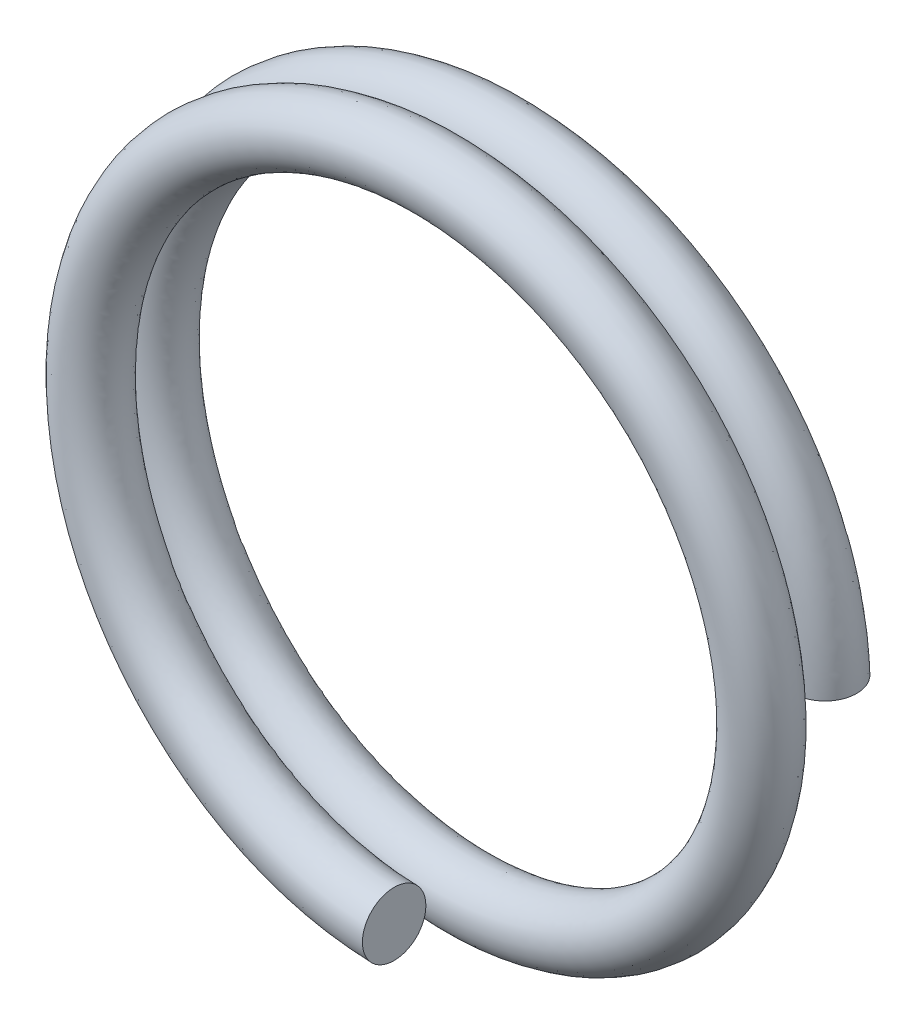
ISO-10303-21;
HEADER;
FILE_DESCRIPTION(('STEP AP214'),'2;1');
FILE_NAME('part.step','',(''),(''),'','','');
FILE_SCHEMA(('AUTOMOTIVE_DESIGN { 1 0 10303 214 1 1 1 1 }'));
ENDSEC;
DATA;
#1=APPLICATION_CONTEXT('core data for automotive mechanical design processes');
#2=APPLICATION_PROTOCOL_DEFINITION('international standard','automotive_design',2000,#1);
#3=PRODUCT_CONTEXT('',#1,'mechanical');
#4=PRODUCT('Part','Part','',(#3));
#5=PRODUCT_RELATED_PRODUCT_CATEGORY('part','',(#4));
#6=PRODUCT_DEFINITION_FORMATION('','',#4);
#7=PRODUCT_DEFINITION_CONTEXT('part definition',#1,'design');
#8=PRODUCT_DEFINITION('design','',#6,#7);
#9=PRODUCT_DEFINITION_SHAPE('','',#8);
#10=(LENGTH_UNIT() NAMED_UNIT(*) SI_UNIT(.MILLI.,.METRE.));
#11=(NAMED_UNIT(*) PLANE_ANGLE_UNIT() SI_UNIT($,.RADIAN.));
#12=(NAMED_UNIT(*) SI_UNIT($,.STERADIAN.) SOLID_ANGLE_UNIT());
#13=UNCERTAINTY_MEASURE_WITH_UNIT(LENGTH_MEASURE(1.E-05),#10,'distance_accuracy_value','');
#14=(GEOMETRIC_REPRESENTATION_CONTEXT(3) GLOBAL_UNCERTAINTY_ASSIGNED_CONTEXT((#13)) GLOBAL_UNIT_ASSIGNED_CONTEXT((#10,
#11,#12)) REPRESENTATION_CONTEXT('',''));
#15=CARTESIAN_POINT('',(0.,0.,0.));
#16=DIRECTION('',(0.,0.,1.));
#17=DIRECTION('',(1.,0.,0.));
#18=AXIS2_PLACEMENT_3D('',#15,#16,#17);
#19=CARTESIAN_POINT('',(0.,-11.1125,0.));
#20=DIRECTION('',(1.,0.,0.));
#21=DIRECTION('',(0.,0.,-1.));
#22=AXIS2_PLACEMENT_3D('',#19,#20,#21);
#23=PLANE('',#22);
#24=CARTESIAN_POINT('',(0.,-11.1125,0.));
#25=DIRECTION('',(1.,0.,0.));
#26=DIRECTION('',(0.,0.,-1.));
#27=AXIS2_PLACEMENT_3D('',#24,#25,#26);
#28=CIRCLE('',#27,1.1049);
#29=CARTESIAN_POINT('',(0.,-11.1125,-1.1049));
#30=VERTEX_POINT('',#29);
#31=EDGE_CURVE('E42',#30,#30,#28,.T.);
#32=ORIENTED_EDGE('',*,*,#31,.T.);
#33=EDGE_LOOP('',(#32));
#34=FACE_BOUND('',#33,.T.);
#35=ADVANCED_FACE('F35',(#34),#23,.T.);
#36=CARTESIAN_POINT('',(11.1125,-2.7159360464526E-13,-3.889375));
#37=DIRECTION('',(0.,1.,0.));
#38=DIRECTION('',(0.,0.,-1.));
#39=AXIS2_PLACEMENT_3D('',#36,#37,#38);
#40=PLANE('',#39);
#41=CARTESIAN_POINT('',(11.1125,-2.7159360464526E-13,-3.889375));
#42=DIRECTION('',(0.,1.,0.));
#43=DIRECTION('',(0.,0.,-1.));
#44=AXIS2_PLACEMENT_3D('',#41,#42,#43);
#45=CIRCLE('',#44,1.1049);
#46=CARTESIAN_POINT('',(11.1125,-2.7159360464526E-13,-4.994275));
#47=VERTEX_POINT('',#46);
#48=EDGE_CURVE('E11',#47,#47,#45,.T.);
#49=ORIENTED_EDGE('',*,*,#48,.F.);
#50=EDGE_LOOP('',(#49));
#51=FACE_BOUND('',#50,.T.);
#52=ADVANCED_FACE('F51',(#51),#40,.F.);
#53=CARTESIAN_POINT('',(0.,-11.1125,-1.1049));
#54=CARTESIAN_POINT('',(-6.41580486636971,-11.1125,-1.29010833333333));
#55=CARTESIAN_POINT('',(-9.62370729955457,-5.55625,-1.47531666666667));
#56=CARTESIAN_POINT('',(-12.8316097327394,0.,-1.660525));
#57=CARTESIAN_POINT('',(-9.62370729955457,5.55625,-1.84573333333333));
#58=CARTESIAN_POINT('',(-6.41580486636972,11.1125,-2.03094166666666));
#59=CARTESIAN_POINT('',(0.,11.1125,-2.21615));
#60=CARTESIAN_POINT('',(6.41580486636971,11.1125,-2.40135833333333));
#61=CARTESIAN_POINT('',(9.62370729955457,5.55625,-2.58656666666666));
#62=CARTESIAN_POINT('',(12.8316097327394,0.,-2.771775));
#63=CARTESIAN_POINT('',(9.62370729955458,-5.55624999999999,-2.95698333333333));
#64=CARTESIAN_POINT('',(6.41580486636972,-11.1125,-3.14219166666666));
#65=CARTESIAN_POINT('',(0.,-11.1125,-3.3274));
#66=CARTESIAN_POINT('',(-6.41580486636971,-11.1125,-3.51260833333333));
#67=CARTESIAN_POINT('',(-9.62370729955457,-5.55625,-3.69781666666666));
#68=CARTESIAN_POINT('',(-12.8316097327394,0.,-3.88302499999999));
#69=CARTESIAN_POINT('',(-9.62370729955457,5.55625,-4.06823333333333));
#70=CARTESIAN_POINT('',(-6.41580486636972,11.1125,-4.25344166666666));
#71=CARTESIAN_POINT('',(0.,11.1125,-4.43864999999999));
#72=CARTESIAN_POINT('',(6.41580486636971,11.1125,-4.62385833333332));
#73=CARTESIAN_POINT('',(9.62370729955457,5.55625,-4.80906666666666));
#74=CARTESIAN_POINT('',(12.8316097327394,0.,-4.99427499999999));
#75=CARTESIAN_POINT('',(9.62370729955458,-5.55624999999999,-5.17948333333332));
#76=CARTESIAN_POINT('',(6.41580486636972,-11.1125,-5.36469166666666));
#77=CARTESIAN_POINT('',(0.,-11.1125,-5.54989999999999));
#78=CARTESIAN_POINT('',(0.,-8.9027,-1.1049));
#79=CARTESIAN_POINT('',(-5.13997624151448,-8.9027,-1.29010833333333));
#80=CARTESIAN_POINT('',(-7.70996436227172,-4.45135,-1.47531666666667));
#81=CARTESIAN_POINT('',(-10.279952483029,0.,-1.660525));
#82=CARTESIAN_POINT('',(-7.70996436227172,4.45135,-1.84573333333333));
#83=CARTESIAN_POINT('',(-5.13997624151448,8.9027,-2.03094166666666));
#84=CARTESIAN_POINT('',(0.,8.9027,-2.21615));
#85=CARTESIAN_POINT('',(5.13997624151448,8.9027,-2.40135833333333));
#86=CARTESIAN_POINT('',(7.70996436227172,4.45135,-2.58656666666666));
#87=CARTESIAN_POINT('',(10.279952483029,0.,-2.771775));
#88=CARTESIAN_POINT('',(7.70996436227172,-4.45134999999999,-2.95698333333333));
#89=CARTESIAN_POINT('',(5.13997624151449,-8.90269999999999,-3.14219166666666));
#90=CARTESIAN_POINT('',(0.,-8.9027,-3.3274));
#91=CARTESIAN_POINT('',(-5.13997624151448,-8.9027,-3.51260833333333));
#92=CARTESIAN_POINT('',(-7.70996436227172,-4.45135,-3.69781666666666));
#93=CARTESIAN_POINT('',(-10.279952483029,0.,-3.88302499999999));
#94=CARTESIAN_POINT('',(-7.70996436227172,4.45135,-4.06823333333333));
#95=CARTESIAN_POINT('',(-5.13997624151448,8.9027,-4.25344166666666));
#96=CARTESIAN_POINT('',(0.,8.9027,-4.43864999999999));
#97=CARTESIAN_POINT('',(5.13997624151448,8.9027,-4.62385833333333));
#98=CARTESIAN_POINT('',(7.70996436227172,4.45135,-4.80906666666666));
#99=CARTESIAN_POINT('',(10.279952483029,0.,-4.99427499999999));
#100=CARTESIAN_POINT('',(7.70996436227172,-4.45134999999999,-5.17948333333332));
#101=CARTESIAN_POINT('',(5.13997624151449,-8.90269999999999,-5.36469166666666));
#102=CARTESIAN_POINT('',(0.,-8.9027,-5.54989999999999));
#103=CARTESIAN_POINT('',(0.,-8.9027,1.1049));
#104=CARTESIAN_POINT('',(-5.13997624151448,-8.9027,0.919691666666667));
#105=CARTESIAN_POINT('',(-7.70996436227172,-4.45135,0.734483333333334));
#106=CARTESIAN_POINT('',(-10.279952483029,0.,0.549275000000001));
#107=CARTESIAN_POINT('',(-7.70996436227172,4.45135,0.364066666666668));
#108=CARTESIAN_POINT('',(-5.13997624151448,8.9027,0.178858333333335));
#109=CARTESIAN_POINT('',(0.,8.9027,-0.00634999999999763));
#110=CARTESIAN_POINT('',(5.13997624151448,8.9027,-0.191558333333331));
#111=CARTESIAN_POINT('',(7.70996436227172,4.45135,-0.376766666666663));
#112=CARTESIAN_POINT('',(10.279952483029,0.,-0.561974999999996));
#113=CARTESIAN_POINT('',(7.70996436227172,-4.45134999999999,-0.747183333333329));
#114=CARTESIAN_POINT('',(5.13997624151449,-8.90269999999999,-0.932391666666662));
#115=CARTESIAN_POINT('',(0.,-8.9027,-1.1176));
#116=CARTESIAN_POINT('',(-5.13997624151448,-8.9027,-1.30280833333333));
#117=CARTESIAN_POINT('',(-7.70996436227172,-4.45135,-1.48801666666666));
#118=CARTESIAN_POINT('',(-10.279952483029,0.,-1.67322499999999));
#119=CARTESIAN_POINT('',(-7.70996436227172,4.45135,-1.85843333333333));
#120=CARTESIAN_POINT('',(-5.13997624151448,8.9027,-2.04364166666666));
#121=CARTESIAN_POINT('',(0.,8.9027,-2.22884999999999));
#122=CARTESIAN_POINT('',(5.13997624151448,8.9027,-2.41405833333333));
#123=CARTESIAN_POINT('',(7.70996436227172,4.45135,-2.59926666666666));
#124=CARTESIAN_POINT('',(10.279952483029,0.,-2.78447499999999));
#125=CARTESIAN_POINT('',(7.70996436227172,-4.45134999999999,-2.96968333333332));
#126=CARTESIAN_POINT('',(5.13997624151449,-8.90269999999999,-3.15489166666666));
#127=CARTESIAN_POINT('',(0.,-8.9027,-3.34009999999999));
#128=CARTESIAN_POINT('',(0.,-11.1125,1.1049));
#129=CARTESIAN_POINT('',(-6.41580486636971,-11.1125,0.919691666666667));
#130=CARTESIAN_POINT('',(-9.62370729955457,-5.55625,0.734483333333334));
#131=CARTESIAN_POINT('',(-12.8316097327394,0.,0.549275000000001));
#132=CARTESIAN_POINT('',(-9.62370729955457,5.55625,0.364066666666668));
#133=CARTESIAN_POINT('',(-6.41580486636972,11.1125,0.178858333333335));
#134=CARTESIAN_POINT('',(0.,11.1125,-0.00634999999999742));
#135=CARTESIAN_POINT('',(6.41580486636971,11.1125,-0.19155833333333));
#136=CARTESIAN_POINT('',(9.62370729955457,5.55625,-0.376766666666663));
#137=CARTESIAN_POINT('',(12.8316097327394,0.,-0.561974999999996));
#138=CARTESIAN_POINT('',(9.62370729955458,-5.55624999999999,-0.747183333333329));
#139=CARTESIAN_POINT('',(6.41580486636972,-11.1125,-0.932391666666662));
#140=CARTESIAN_POINT('',(0.,-11.1125,-1.11759999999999));
#141=CARTESIAN_POINT('',(-6.41580486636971,-11.1125,-1.30280833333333));
#142=CARTESIAN_POINT('',(-9.62370729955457,-5.55625,-1.48801666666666));
#143=CARTESIAN_POINT('',(-12.8316097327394,0.,-1.67322499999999));
#144=CARTESIAN_POINT('',(-9.62370729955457,5.55625,-1.85843333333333));
#145=CARTESIAN_POINT('',(-6.41580486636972,11.1125,-2.04364166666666));
#146=CARTESIAN_POINT('',(0.,11.1125,-2.22884999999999));
#147=CARTESIAN_POINT('',(6.41580486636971,11.1125,-2.41405833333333));
#148=CARTESIAN_POINT('',(9.62370729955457,5.55625,-2.59926666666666));
#149=CARTESIAN_POINT('',(12.8316097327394,0.,-2.78447499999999));
#150=CARTESIAN_POINT('',(9.62370729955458,-5.55624999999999,-2.96968333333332));
#151=CARTESIAN_POINT('',(6.41580486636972,-11.1125,-3.15489166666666));
#152=CARTESIAN_POINT('',(0.,-11.1125,-3.34009999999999));
#153=CARTESIAN_POINT('',(0.,-13.3223,1.1049));
#154=CARTESIAN_POINT('',(-7.69163349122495,-13.3223,0.919691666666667));
#155=CARTESIAN_POINT('',(-11.5374502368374,-6.66115,0.734483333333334));
#156=CARTESIAN_POINT('',(-15.3832669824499,0.,0.549275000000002));
#157=CARTESIAN_POINT('',(-11.5374502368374,6.66115,0.364066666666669));
#158=CARTESIAN_POINT('',(-7.69163349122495,13.3223,0.178858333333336));
#159=CARTESIAN_POINT('',(0.,13.3223,-0.0063499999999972));
#160=CARTESIAN_POINT('',(7.69163349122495,13.3223,-0.19155833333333));
#161=CARTESIAN_POINT('',(11.5374502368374,6.66115,-0.376766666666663));
#162=CARTESIAN_POINT('',(15.3832669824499,0.,-0.561974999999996));
#163=CARTESIAN_POINT('',(11.5374502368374,-6.66114999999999,-0.747183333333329));
#164=CARTESIAN_POINT('',(7.69163349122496,-13.3223,-0.932391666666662));
#165=CARTESIAN_POINT('',(0.,-13.3223,-1.11759999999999));
#166=CARTESIAN_POINT('',(-7.69163349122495,-13.3223,-1.30280833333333));
#167=CARTESIAN_POINT('',(-11.5374502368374,-6.66115,-1.48801666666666));
#168=CARTESIAN_POINT('',(-15.3832669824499,0.,-1.67322499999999));
#169=CARTESIAN_POINT('',(-11.5374502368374,6.66115,-1.85843333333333));
#170=CARTESIAN_POINT('',(-7.69163349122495,13.3223,-2.04364166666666));
#171=CARTESIAN_POINT('',(0.,13.3223,-2.22884999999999));
#172=CARTESIAN_POINT('',(7.69163349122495,13.3223,-2.41405833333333));
#173=CARTESIAN_POINT('',(11.5374502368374,6.66115,-2.59926666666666));
#174=CARTESIAN_POINT('',(15.3832669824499,0.,-2.78447499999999));
#175=CARTESIAN_POINT('',(11.5374502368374,-6.66114999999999,-2.96968333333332));
#176=CARTESIAN_POINT('',(7.69163349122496,-13.3223,-3.15489166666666));
#177=CARTESIAN_POINT('',(0.,-13.3223,-3.34009999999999));
#178=CARTESIAN_POINT('',(0.,-13.3223,-1.1049));
#179=CARTESIAN_POINT('',(-7.69163349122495,-13.3223,-1.29010833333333));
#180=CARTESIAN_POINT('',(-11.5374502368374,-6.66115,-1.47531666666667));
#181=CARTESIAN_POINT('',(-15.3832669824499,0.,-1.660525));
#182=CARTESIAN_POINT('',(-11.5374502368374,6.66115,-1.84573333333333));
#183=CARTESIAN_POINT('',(-7.69163349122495,13.3223,-2.03094166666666));
#184=CARTESIAN_POINT('',(0.,13.3223,-2.21615));
#185=CARTESIAN_POINT('',(7.69163349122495,13.3223,-2.40135833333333));
#186=CARTESIAN_POINT('',(11.5374502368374,6.66115,-2.58656666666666));
#187=CARTESIAN_POINT('',(15.3832669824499,0.,-2.771775));
#188=CARTESIAN_POINT('',(11.5374502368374,-6.66114999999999,-2.95698333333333));
#189=CARTESIAN_POINT('',(7.69163349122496,-13.3223,-3.14219166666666));
#190=CARTESIAN_POINT('',(0.,-13.3223,-3.3274));
#191=CARTESIAN_POINT('',(-7.69163349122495,-13.3223,-3.51260833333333));
#192=CARTESIAN_POINT('',(-11.5374502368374,-6.66115,-3.69781666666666));
#193=CARTESIAN_POINT('',(-15.3832669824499,0.,-3.88302499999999));
#194=CARTESIAN_POINT('',(-11.5374502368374,6.66115,-4.06823333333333));
#195=CARTESIAN_POINT('',(-7.69163349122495,13.3223,-4.25344166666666));
#196=CARTESIAN_POINT('',(0.,13.3223,-4.43864999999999));
#197=CARTESIAN_POINT('',(7.69163349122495,13.3223,-4.62385833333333));
#198=CARTESIAN_POINT('',(11.5374502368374,6.66115,-4.80906666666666));
#199=CARTESIAN_POINT('',(15.3832669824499,0.,-4.99427499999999));
#200=CARTESIAN_POINT('',(11.5374502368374,-6.66114999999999,-5.17948333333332));
#201=CARTESIAN_POINT('',(7.69163349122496,-13.3223,-5.36469166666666));
#202=CARTESIAN_POINT('',(0.,-13.3223,-5.54989999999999));
#203=CARTESIAN_POINT('',(0.,-11.1125,-1.1049));
#204=CARTESIAN_POINT('',(-6.41580486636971,-11.1125,-1.29010833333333));
#205=CARTESIAN_POINT('',(-9.62370729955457,-5.55625,-1.47531666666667));
#206=CARTESIAN_POINT('',(-12.8316097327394,0.,-1.660525));
#207=CARTESIAN_POINT('',(-9.62370729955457,5.55625,-1.84573333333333));
#208=CARTESIAN_POINT('',(-6.41580486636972,11.1125,-2.03094166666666));
#209=CARTESIAN_POINT('',(0.,11.1125,-2.21615));
#210=CARTESIAN_POINT('',(6.41580486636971,11.1125,-2.40135833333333));
#211=CARTESIAN_POINT('',(9.62370729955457,5.55625,-2.58656666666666));
#212=CARTESIAN_POINT('',(12.8316097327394,0.,-2.771775));
#213=CARTESIAN_POINT('',(9.62370729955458,-5.55624999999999,-2.95698333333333));
#214=CARTESIAN_POINT('',(6.41580486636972,-11.1125,-3.14219166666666));
#215=CARTESIAN_POINT('',(0.,-11.1125,-3.3274));
#216=CARTESIAN_POINT('',(-6.41580486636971,-11.1125,-3.51260833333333));
#217=CARTESIAN_POINT('',(-9.62370729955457,-5.55625,-3.69781666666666));
#218=CARTESIAN_POINT('',(-12.8316097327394,0.,-3.88302499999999));
#219=CARTESIAN_POINT('',(-9.62370729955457,5.55625,-4.06823333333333));
#220=CARTESIAN_POINT('',(-6.41580486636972,11.1125,-4.25344166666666));
#221=CARTESIAN_POINT('',(0.,11.1125,-4.43864999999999));
#222=CARTESIAN_POINT('',(6.41580486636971,11.1125,-4.62385833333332));
#223=CARTESIAN_POINT('',(9.62370729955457,5.55625,-4.80906666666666));
#224=CARTESIAN_POINT('',(12.8316097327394,0.,-4.99427499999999));
#225=CARTESIAN_POINT('',(9.62370729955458,-5.55624999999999,-5.17948333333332));
#226=CARTESIAN_POINT('',(6.41580486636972,-11.1125,-5.36469166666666));
#227=CARTESIAN_POINT('',(0.,-11.1125,-5.54989999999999));
#228=(BOUNDED_SURFACE() B_SPLINE_SURFACE(3,2,((#53,#54,#55,#56,#57,#58,#59,#60,#61,#62,#63,#64,
#65,#66,#67,#68,#69,#70,#71,#72,#73,#74,#75,#76,#77),(#78,#79,#80,#81,#82,#83,#84,#85,#86,#87,
#88,#89,#90,#91,#92,#93,#94,#95,#96,#97,#98,#99,#100,#101,#102),(#103,#104,#105,#106,#107,#108,
#109,#110,#111,#112,#113,#114,#115,#116,#117,#118,#119,#120,#121,#122,#123,#124,#125,#126,#127),
(#128,#129,#130,#131,#132,#133,#134,#135,#136,#137,#138,#139,#140,#141,#142,#143,#144,#145,#146,
#147,#148,#149,#150,#151,#152),(#153,#154,#155,#156,#157,#158,#159,#160,#161,#162,#163,#164,
#165,#166,#167,#168,#169,#170,#171,#172,#173,#174,#175,#176,#177),(#178,#179,#180,#181,#182,
#183,#184,#185,#186,#187,#188,#189,#190,#191,#192,#193,#194,#195,#196,#197,#198,#199,#200,#201,
#202),(#203,#204,#205,#206,#207,#208,#209,#210,#211,#212,#213,#214,#215,#216,#217,#218,#219,
#220,#221,#222,#223,#224,#225,#226,#227)),.UNSPECIFIED.,.T.,.F.,
.F.) B_SPLINE_SURFACE_WITH_KNOTS((4,3,4),(3,2,2,2,2,2,2,2,2,2,2,2,3),(0.,0.5,1.),(0.,
0.0833333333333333,0.166666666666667,0.25,0.333333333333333,0.416666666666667,0.5,
0.583333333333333,0.666666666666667,0.75,0.833333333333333,0.916666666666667,1.),
.UNSPECIFIED.) GEOMETRIC_REPRESENTATION_ITEM() RATIONAL_B_SPLINE_SURFACE(((1.,0.866025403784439,
1.,0.866025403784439,1.,0.866025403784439,1.,0.866025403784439,1.,0.866025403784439,1.,
0.866025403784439,1.,0.866025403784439,1.,0.866025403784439,1.,0.866025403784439,1.,
0.866025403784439,1.,0.866025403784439,1.,0.866025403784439,1.),(0.333333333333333,
0.288675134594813,0.333333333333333,0.288675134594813,0.333333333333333,0.288675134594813,
0.333333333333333,0.288675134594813,0.333333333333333,0.288675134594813,0.333333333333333,
0.288675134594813,0.333333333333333,0.288675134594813,0.333333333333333,0.288675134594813,
0.333333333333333,0.288675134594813,0.333333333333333,0.288675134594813,0.333333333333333,
0.288675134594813,0.333333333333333,0.288675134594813,0.333333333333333),(0.333333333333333,
0.288675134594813,0.333333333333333,0.288675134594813,0.333333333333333,0.288675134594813,
0.333333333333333,0.288675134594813,0.333333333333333,0.288675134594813,0.333333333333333,
0.288675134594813,0.333333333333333,0.288675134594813,0.333333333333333,0.288675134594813,
0.333333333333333,0.288675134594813,0.333333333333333,0.288675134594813,0.333333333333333,
0.288675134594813,0.333333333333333,0.288675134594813,0.333333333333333),(1.,0.866025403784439,
1.,0.866025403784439,1.,0.866025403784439,1.,0.866025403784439,1.,0.866025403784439,1.,
0.866025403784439,1.,0.866025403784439,1.,0.866025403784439,1.,0.866025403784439,1.,
0.866025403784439,1.,0.866025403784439,1.,0.866025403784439,1.),(0.333333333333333,
0.288675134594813,0.333333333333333,0.288675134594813,0.333333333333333,0.288675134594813,
0.333333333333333,0.288675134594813,0.333333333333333,0.288675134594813,0.333333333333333,
0.288675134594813,0.333333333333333,0.288675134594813,0.333333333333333,0.288675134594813,
0.333333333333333,0.288675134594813,0.333333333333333,0.288675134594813,0.333333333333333,
0.288675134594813,0.333333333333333,0.288675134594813,0.333333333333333),(0.333333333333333,
0.288675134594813,0.333333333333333,0.288675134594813,0.333333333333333,0.288675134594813,
0.333333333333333,0.288675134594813,0.333333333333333,0.288675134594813,0.333333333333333,
0.288675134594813,0.333333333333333,0.288675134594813,0.333333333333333,0.288675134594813,
0.333333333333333,0.288675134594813,0.333333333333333,0.288675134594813,0.333333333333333,
0.288675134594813,0.333333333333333,0.288675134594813,0.333333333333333),(1.,0.866025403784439,
1.,0.866025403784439,1.,0.866025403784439,1.,0.866025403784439,1.,0.866025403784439,1.,
0.866025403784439,1.,0.866025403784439,1.,0.866025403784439,1.,0.866025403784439,1.,
0.866025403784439,1.,0.866025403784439,1.,0.866025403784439,1.))) REPRESENTATION_ITEM('') SURFACE());
#229=ORIENTED_EDGE('',*,*,#48,.T.);
#230=EDGE_LOOP('',(#229));
#231=FACE_BOUND('',#230,.T.);
#232=ORIENTED_EDGE('',*,*,#31,.F.);
#233=EDGE_LOOP('',(#232));
#234=FACE_BOUND('',#233,.T.);
#235=ADVANCED_FACE('F49',(#231,#234),#228,.F.);
#236=CLOSED_SHELL('',(#35,#52,#235));
#237=MANIFOLD_SOLID_BREP('B2',#236);
#238=ADVANCED_BREP_SHAPE_REPRESENTATION('',(#18,#237),#14);
#239=SHAPE_DEFINITION_REPRESENTATION(#9,#238);
ENDSEC;
END-ISO-10303-21;
